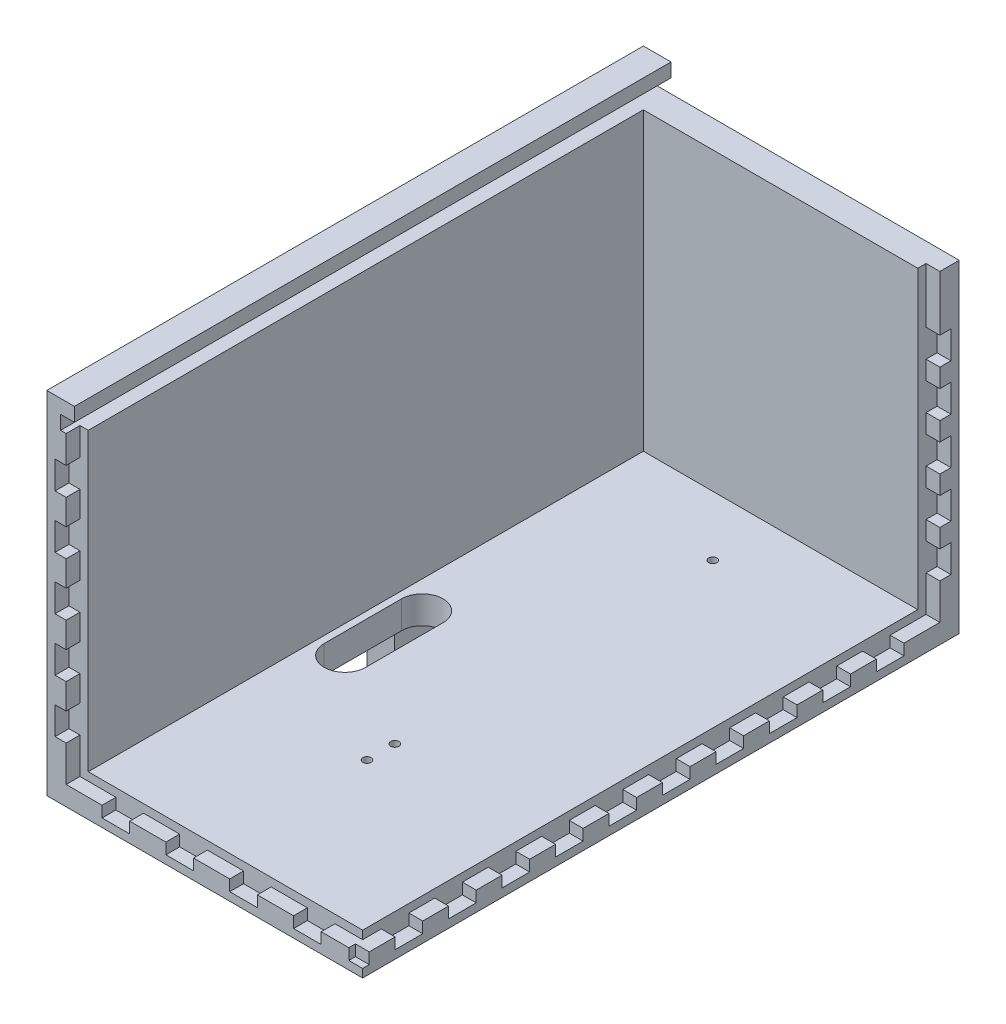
from build123d import *

# Parameters (mm, degrees)
BOSS_EXTRUDE2_DEPTH               = 114.3
SHELL2_T                          = -10
CUT_EXTRUDE2_DEPTH                = 299.8
SKETCH5_W                         = 208.6
SKETCH5_H                         = 5
CUT_EXTRUDE3_DEPTH                = 10
BASE_HOLE_W                       = 152.5
BASE_HOLE_H                       = 152
CUT_EXTRUDE5_DEPTH                = 10
SKETCH16_W                        = 56.5
SKETCH16_H                        = 56.5
CUT_EXTRUDE7_DEPTH                = 120
SKETCH17_W                        = 56.5
SKETCH17_H                        = 47.75
CUT_EXTRUDE8_DEPTH                = 120
SIDEWALL_MOTOR_TABS1_W            = 100
SIDEWALL_MOTOR_TABS1_H            = 30
MOTOR_MOUNT_WALL1_DEPTH           = 10
SIDEWALL_MOTOR_TABS2_W            = 100
SIDEWALL_MOTOR_TABS2_H            = 30
MOTOR_MOUNT_WALL2_DEPTH           = 10
CUT_EXTRUDE_REAR_SLOTS_DEPTH      = 10
CUT_EXTRUDE_FRONT_SLOTS_DEPTH     = 10
SKETCH25_R                        = 3
SKETCH25_R_2                      = 1.55
MOTOR_HOLES_DEPTH                 = 505.815015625
REFERENCE1_BASE_R                 = 1.55
CUT_EXTRUDE9_DEPTH                = 10
SKETCH26_R                        = 1.5
CUT_EXTRUDE_TOWERBASE_HOLES_DEPTH = 10
SKETCH27_W                        = 431.8
SKETCH27_H                        = 157
CUT_EXTRUDE10_DEPTH               = 465.375634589
CUT_EXTRUDE11_DEPTH               = 5
SKETCH31_W                        = 4
SKETCH31_H                        = 10
SKETCH31_W_2                      = 10
SKETCH31_H_2                      = 4
CUT_EXTRUDE12_DEPTH               = 5
SKETCH33_W                        = 114.3
SKETCH33_H                        = 157
CUT_EXTRUDE13_DEPTH               = 276.329439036
CUT_EXTRUDE14_DEPTH               = 5
SKETCH35_W                        = 10
SKETCH35_H                        = 4
SKETCH35_W_2                      = 4
SKETCH35_H_2                      = 10
CUT_EXTRUDE15_DEPTH               = 5


with BuildPart() as part:
    # Sketch3 → Boss-Extrude2 (new, symmetric)
    with BuildSketch(Plane(origin=(0, 0, 0), x_dir=(0, 0, -1), z_dir=(1, 0, 0))):
        Polygon((0, 0), (431.8, 0), (431.8, 127), (127, 127), align=None)
    extrude(amount=BOSS_EXTRUDE2_DEPTH, both=True)

    # Shell2
    shell2_openings = [part.faces().sort_by_distance(p)[0] for p in [
        (0, 127, -279.4),
    ]]
    offset(amount=SHELL2_T, openings=shell2_openings, kind=Kind.INTERSECTION)

    # Sketch4 → Cut-Extrude2 (cut)
    with BuildSketch(Plane(origin=(0, 0, -431.8), x_dir=(-1, 0, 0), z_dir=(0, 0, -1))):
        Polygon((-104.3, 122), (-109.3, 122), (-109.3, 117), (-104.3, 117), (104.3, 117), (109.3, 117), (109.3, 122), (104.3, 122), align=None)
    extrude(amount=-CUT_EXTRUDE2_DEPTH, mode=Mode.SUBTRACT)

    # Sketch5 → Cut-Extrude3 (cut)
    with BuildSketch(Plane(origin=(0, 0, -431.8), x_dir=(-1, 0, 0), z_dir=(0, 0, -1))):
        with Locations((0, 124.5)):
            Rectangle(SKETCH5_W, SKETCH5_H)
    extrude(amount=-CUT_EXTRUDE3_DEPTH, mode=Mode.SUBTRACT)

    # Base hole → Cut-Extrude5 (cut)
    with BuildSketch(Plane(origin=(0, 10, 0), x_dir=(1, 0, 0), z_dir=(0, 1, 0))):
        with Locations((0, 86)):
            Rectangle(BASE_HOLE_W, BASE_HOLE_H)
    extrude(amount=CUT_EXTRUDE5_DEPTH, mode=Mode.SUBTRACT)

    # Sketch16 → Cut-Extrude7 (cut)
    with BuildSketch(Plane(origin=(0, 10, 0), x_dir=(1, 0, 0), z_dir=(0, 1, 0))):
        with Locations((0, 86)):
            Rectangle(SKETCH16_W, SKETCH16_H)
    extrude(amount=CUT_EXTRUDE7_DEPTH, mode=Mode.SUBTRACT)

    # Sketch17 → Cut-Extrude8 (cut)
    with BuildSketch(Plane(origin=(0, 10, 0), x_dir=(1, 0, 0), z_dir=(0, 1, 0))):
        with Locations((0, 33.875)):
            Rectangle(SKETCH17_W, SKETCH17_H)
    extrude(amount=CUT_EXTRUDE8_DEPTH, mode=Mode.SUBTRACT)

    # Sidewall_Motor_Tabs1 → Motor_Mount_Wall1 (add)
    with BuildSketch(Plane(origin=(114.3, 0, 0), x_dir=(0, 0, -1), z_dir=(1, 0, 0))):
        Polygon((0, 0), (30, -30), (100, -30), (100, 0), align=None)
        with Locations((381.8, -15)):
            Rectangle(SIDEWALL_MOTOR_TABS1_W, SIDEWALL_MOTOR_TABS1_H)
    extrude(amount=-MOTOR_MOUNT_WALL1_DEPTH)

    # Sidewall_Motor_Tabs2 → Motor_Mount_Wall2 (add)
    with BuildSketch(Plane.ZY.offset(114.3)):
        Polygon((0, 0), (-30, -30), (-100, -30), (-100, 0), align=None)
        with Locations((-381.8, -15)):
            Rectangle(SIDEWALL_MOTOR_TABS2_W, SIDEWALL_MOTOR_TABS2_H)
    extrude(amount=-MOTOR_MOUNT_WALL2_DEPTH)

    # Rear Slots → Cut-Extrude_Rear Slots (cut)
    with BuildSketch(Plane(origin=(0, 10, 0), x_dir=(1, 0, 0), z_dir=(0, 1, 0))):
        with BuildLine():
            Line((-86.8, 331.8), (-86.8, 303.8))
            ThreePointArc((-86.8, 303.8), (-94.3, 296.3), (-101.8, 303.8))
            Line((-101.8, 303.8), (-101.8, 331.8))
            ThreePointArc((-101.8, 331.8), (-94.3, 339.3), (-86.8, 331.8))
        make_face()
        with BuildLine():
            Line((86.8, 331.8), (86.8, 303.8))
            ThreePointArc((86.8, 303.8), (94.3, 296.3), (101.8, 303.8))
            Line((101.8, 303.8), (101.8, 331.8))
            ThreePointArc((101.8, 331.8), (94.3, 339.3), (86.8, 331.8))
        make_face()
    extrude(amount=-CUT_EXTRUDE_REAR_SLOTS_DEPTH, mode=Mode.SUBTRACT)

    # Front Slots → Cut-Extrude_Front Slots (cut)
    with BuildSketch(Plane(origin=(0, 10, 0), x_dir=(1, 0, 0), z_dir=(0, 1, 0))):
        with BuildLine():
            Line((-86.8, 128), (-86.8, 100))
            ThreePointArc((-86.8, 100), (-94.3, 92.5), (-101.8, 100))
            Line((-101.8, 100), (-101.8, 128))
            ThreePointArc((-101.8, 128), (-94.3, 135.5), (-86.8, 128))
        make_face()
        with BuildLine():
            Line((86.8, 128), (86.8, 100))
            ThreePointArc((86.8, 100), (94.3, 92.5), (101.8, 100))
            Line((101.8, 100), (101.8, 128))
            ThreePointArc((101.8, 128), (94.3, 135.5), (86.8, 128))
        make_face()
    extrude(amount=-CUT_EXTRUDE_FRONT_SLOTS_DEPTH, mode=Mode.SUBTRACT)

    # Sketch25 → Motor_Holes (cut, through all)
    with BuildSketch(Plane.ZY.offset(114.3)):
        with Locations((-385.2, -15)):
            Circle(SKETCH25_R)
        with Locations((-365.1, -6.25)):
            Circle(SKETCH25_R_2)
        with Locations((-365.1, -23.75)):
            Circle(SKETCH25_R_2)
        with Locations((-66.7, -23.75)):
            Circle(SKETCH25_R_2)
        with Locations((-66.7, -6.25)):
            Circle(SKETCH25_R_2)
        with Locations((-46.6, -15)):
            Circle(SKETCH25_R)
    extrude(amount=-MOTOR_HOLES_DEPTH, mode=Mode.SUBTRACT)

    # Reference1 Base → Cut-Extrude9 (cut)
    with BuildSketch(Plane.XZ):
        with Locations(Location((-68.2, -144.4, 0), (0, 0, 270))):
            Circle(REFERENCE1_BASE_R)
        with Locations(Location((-68.2, -8, 0), (0, 0, 270))):
            Circle(REFERENCE1_BASE_R)
        with Locations(Location((68.2, -144.4, 0), (0, 0, 90))):
            Circle(REFERENCE1_BASE_R)
        with Locations(Location((68.2, -8, 0), (0, 0, 90))):
            Circle(REFERENCE1_BASE_R)
    extrude(amount=-CUT_EXTRUDE9_DEPTH, mode=Mode.SUBTRACT)

    # Sketch26 → Cut-Extrude_TowerBase_Holes (cut)
    with BuildSketch(Plane.XZ):
        with Locations(Location((-57.54, -159.94, 0), (0, 0, 270))):
            Circle(SKETCH26_R)
        with Locations(Location((57.54, -159.94, 0), (0, 0, 90))):
            Circle(SKETCH26_R)
        with Locations(Location((-57.54, -275.02, 0), (0, 0, 270))):
            Circle(SKETCH26_R)
        with Locations(Location((57.54, -275.02, 0), (0, 0, 90))):
            Circle(SKETCH26_R)
        with Locations(Location((-57.54, -285.1, 0), (0, 0, 270))):
            Circle(SKETCH26_R)
        with Locations(Location((-57.54, -400.18, 0), (0, 0, 270))):
            Circle(SKETCH26_R)
        with Locations(Location((57.54, -285.1, 0), (0, 0, 90))):
            Circle(SKETCH26_R)
        with Locations(Location((57.54, -400.18, 0), (0, 0, 90))):
            Circle(SKETCH26_R)
    extrude(amount=-CUT_EXTRUDE_TOWERBASE_HOLES_DEPTH, mode=Mode.SUBTRACT)

    # Sketch27 → Cut-Extrude10 (cut, through all)
    with BuildSketch(Plane(origin=(0, 0, 0), x_dir=(0, 0, -1), z_dir=(1, 0, 0))):
        with Locations((215.9, 48.5)):
            Rectangle(SKETCH27_W, SKETCH27_H)
    extrude(amount=CUT_EXTRUDE10_DEPTH, mode=Mode.SUBTRACT)

    # Sketch28 → Cut-Extrude11 (cut)
    with BuildSketch(Plane(origin=(0, 0, 0), x_dir=(0, 0, -1), z_dir=(1, 0, 0))):
        Polygon((24.142135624, 10), (421.8, 10), (421.8, 117), (424.8, 117), (424.8, 7), (24.142135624, 7), align=None)
    extrude(amount=-CUT_EXTRUDE11_DEPTH, mode=Mode.SUBTRACT)

    # Sketch31 → Cut-Extrude12 (cut)
    with BuildSketch(Plane(origin=(0, 0, 0), x_dir=(0, 0, -1), z_dir=(1, 0, 0))):
        with Locations((426.8, 25)):
            Rectangle(SKETCH31_W, SKETCH31_H)
        with Locations((406.8, 5)):
            Rectangle(SKETCH31_W_2, SKETCH31_H_2)
        with Locations((387.449586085, 5)):
            Rectangle(SKETCH31_W_2, SKETCH31_H_2)
        with Locations((368.099172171, 5)):
            Rectangle(SKETCH31_W_2, SKETCH31_H_2)
        with Locations((348.748758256, 5)):
            Rectangle(SKETCH31_W_2, SKETCH31_H_2)
        with Locations((329.398344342, 5)):
            Rectangle(SKETCH31_W_2, SKETCH31_H_2)
        with Locations((310.047930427, 5)):
            Rectangle(SKETCH31_W_2, SKETCH31_H_2)
        with Locations((290.697516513, 5)):
            Rectangle(SKETCH31_W_2, SKETCH31_H_2)
        with Locations((271.347102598, 5)):
            Rectangle(SKETCH31_W_2, SKETCH31_H_2)
        with Locations((251.996688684, 5)):
            Rectangle(SKETCH31_W_2, SKETCH31_H_2)
        with Locations((232.646274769, 5)):
            Rectangle(SKETCH31_W_2, SKETCH31_H_2)
        with Locations((213.295860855, 5)):
            Rectangle(SKETCH31_W_2, SKETCH31_H_2)
        with Locations((193.94544694, 5)):
            Rectangle(SKETCH31_W_2, SKETCH31_H_2)
        with Locations((174.595033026, 5)):
            Rectangle(SKETCH31_W_2, SKETCH31_H_2)
        with Locations((155.244619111, 5)):
            Rectangle(SKETCH31_W_2, SKETCH31_H_2)
        with Locations((135.894205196, 5)):
            Rectangle(SKETCH31_W_2, SKETCH31_H_2)
        with Locations((116.543791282, 5)):
            Rectangle(SKETCH31_W_2, SKETCH31_H_2)
        with Locations((97.193377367, 5)):
            Rectangle(SKETCH31_W_2, SKETCH31_H_2)
        with Locations((77.842963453, 5)):
            Rectangle(SKETCH31_W_2, SKETCH31_H_2)
        with Locations((58.492549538, 5)):
            Rectangle(SKETCH31_W_2, SKETCH31_H_2)
        with Locations((39.142135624, 5)):
            Rectangle(SKETCH31_W_2, SKETCH31_H_2)
        with Locations((426.8, 41.75)):
            Rectangle(SKETCH31_W, SKETCH31_H)
        with Locations((426.8, 58.5)):
            Rectangle(SKETCH31_W, SKETCH31_H)
        with Locations((426.8, 75.25)):
            Rectangle(SKETCH31_W, SKETCH31_H)
        with Locations((426.8, 92)):
            Rectangle(SKETCH31_W, SKETCH31_H)
    extrude(amount=-CUT_EXTRUDE12_DEPTH, mode=Mode.SUBTRACT)

    # Sketch33 → Cut-Extrude13 (cut, through all)
    with BuildSketch(Plane.XY.offset(-215.9)):
        with Locations((-57.15, 48.5)):
            Rectangle(SKETCH33_W, SKETCH33_H)
    extrude(amount=CUT_EXTRUDE13_DEPTH, mode=Mode.SUBTRACT)

    # Sketch34 → Cut-Extrude14 (cut)
    with BuildSketch(Plane.XY.offset(-215.9)):
        Polygon((-104.3, 117), (-107.3, 117), (-107.3, 7), (-5, 7), (-5, 10), (-104.3, 10), align=None)
    extrude(amount=-CUT_EXTRUDE14_DEPTH, mode=Mode.SUBTRACT)

    # Sketch35 → Cut-Extrude15 (cut)
    with BuildSketch(Plane.XY.offset(-215.9)):
        with Locations((-89.3, 5)):
            Rectangle(SKETCH35_W, SKETCH35_H)
        with Locations((-66.2, 5)):
            Rectangle(SKETCH35_W, SKETCH35_H)
        with Locations((-43.1, 5)):
            Rectangle(SKETCH35_W, SKETCH35_H)
        with Locations((-20, 5)):
            Rectangle(SKETCH35_W, SKETCH35_H)
        with Locations((-109.3, 25)):
            Rectangle(SKETCH35_W_2, SKETCH35_H_2)
        with Locations((-109.3, 44.25)):
            Rectangle(SKETCH35_W_2, SKETCH35_H_2)
        with Locations((-109.3, 63.5)):
            Rectangle(SKETCH35_W_2, SKETCH35_H_2)
        with Locations((-109.3, 82.75)):
            Rectangle(SKETCH35_W_2, SKETCH35_H_2)
        with Locations((-109.3, 102)):
            Rectangle(SKETCH35_W_2, SKETCH35_H_2)
    extrude(amount=-CUT_EXTRUDE15_DEPTH, mode=Mode.SUBTRACT)


solid = part.part
